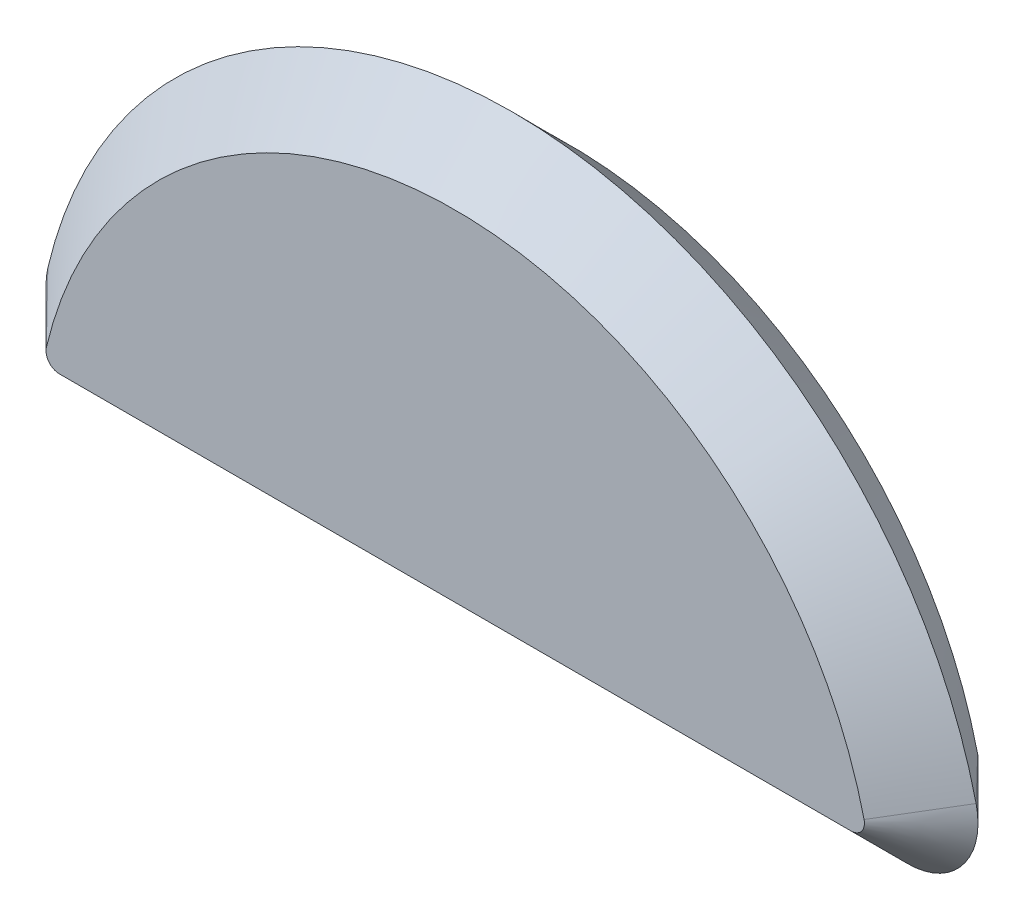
ISO-10303-21;
HEADER;
FILE_DESCRIPTION(('STEP AP214'),'2;1');
FILE_NAME('part.step','',(''),(''),'','','');
FILE_SCHEMA(('AUTOMOTIVE_DESIGN { 1 0 10303 214 1 1 1 1 }'));
ENDSEC;
DATA;
#1=APPLICATION_CONTEXT('core data for automotive mechanical design processes');
#2=APPLICATION_PROTOCOL_DEFINITION('international standard','automotive_design',2000,#1);
#3=PRODUCT_CONTEXT('',#1,'mechanical');
#4=PRODUCT('Part','Part','',(#3));
#5=PRODUCT_RELATED_PRODUCT_CATEGORY('part','',(#4));
#6=PRODUCT_DEFINITION_FORMATION('','',#4);
#7=PRODUCT_DEFINITION_CONTEXT('part definition',#1,'design');
#8=PRODUCT_DEFINITION('design','',#6,#7);
#9=PRODUCT_DEFINITION_SHAPE('','',#8);
#10=(LENGTH_UNIT() NAMED_UNIT(*) SI_UNIT(.MILLI.,.METRE.));
#11=(NAMED_UNIT(*) PLANE_ANGLE_UNIT() SI_UNIT($,.RADIAN.));
#12=(NAMED_UNIT(*) SI_UNIT($,.STERADIAN.) SOLID_ANGLE_UNIT());
#13=UNCERTAINTY_MEASURE_WITH_UNIT(LENGTH_MEASURE(1.E-05),#10,'distance_accuracy_value','');
#14=(GEOMETRIC_REPRESENTATION_CONTEXT(3) GLOBAL_UNCERTAINTY_ASSIGNED_CONTEXT((#13)) GLOBAL_UNIT_ASSIGNED_CONTEXT((#10,
#11,#12)) REPRESENTATION_CONTEXT('',''));
#15=CARTESIAN_POINT('',(0.,0.,0.));
#16=DIRECTION('',(0.,0.,1.));
#17=DIRECTION('',(1.,0.,0.));
#18=AXIS2_PLACEMENT_3D('',#15,#16,#17);
#19=CARTESIAN_POINT('',(-75.1410823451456,17.7799999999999,0.));
#20=DIRECTION('',(0.,0.,-1.));
#21=DIRECTION('',(-0.999999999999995,0.,0.));
#22=AXIS2_PLACEMENT_3D('',#19,#20,#21);
#23=CONICAL_SURFACE('',#22,2.53999999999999,0.785398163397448);
#24=DIRECTION('',(-0.688105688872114,0.162820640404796,-0.707106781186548));
#25=VECTOR('',#24,1.);
#26=CARTESIAN_POINT('',(-77.6128284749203,18.3648684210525,4.44089209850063E-13));
#27=LINE('',#26,#25);
#28=CARTESIAN_POINT('',(-77.6128284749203,18.3648684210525,4.44089209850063E-13));
#29=VERTEX_POINT('',#28);
#30=CARTESIAN_POINT('',(-88.0995591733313,20.8462549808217,-10.776307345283));
#31=VERTEX_POINT('',#30);
#32=EDGE_CURVE('E153',#29,#31,#27,.T.);
#33=ORIENTED_EDGE('',*,*,#32,.T.);
#34=CARTESIAN_POINT('',(-75.1410823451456,17.7799999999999,-10.776307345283));
#35=DIRECTION('',(0.,0.,1.));
#36=DIRECTION('',(0.999999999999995,0.,0.));
#37=AXIS2_PLACEMENT_3D('',#34,#35,#36);
#38=CIRCLE('',#37,13.316307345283);
#39=CARTESIAN_POINT('',(-75.1410823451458,4.46369265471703,-10.7763073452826));
#40=VERTEX_POINT('',#39);
#41=EDGE_CURVE('E38',#31,#40,#38,.T.);
#42=ORIENTED_EDGE('',*,*,#41,.T.);
#43=DIRECTION('',(0.,-0.707106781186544,-0.707106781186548));
#44=VECTOR('',#43,1.);
#45=CARTESIAN_POINT('',(-75.1410823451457,15.2399999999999,0.));
#46=LINE('',#45,#44);
#47=CARTESIAN_POINT('',(-75.1410823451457,15.2399999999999,0.));
#48=VERTEX_POINT('',#47);
#49=EDGE_CURVE('E166',#48,#40,#46,.T.);
#50=ORIENTED_EDGE('',*,*,#49,.F.);
#51=CARTESIAN_POINT('',(-75.1410823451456,17.7799999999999,0.));
#52=DIRECTION('',(0.,0.,1.));
#53=DIRECTION('',(0.999999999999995,0.,0.));
#54=AXIS2_PLACEMENT_3D('',#51,#52,#53);
#55=CIRCLE('',#54,2.53999999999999);
#56=EDGE_CURVE('E11',#29,#48,#55,.T.);
#57=ORIENTED_EDGE('',*,*,#56,.F.);
#58=EDGE_LOOP('',(#33,#42,#50,#57));
#59=FACE_BOUND('',#58,.T.);
#60=ADVANCED_FACE('F30',(#59),#23,.T.);
#61=CARTESIAN_POINT('',(-75.1410823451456,17.7799999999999,-10.776307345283));
#62=DIRECTION('',(0.,0.,1.));
#63=DIRECTION('',(0.999999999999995,0.,0.));
#64=AXIS2_PLACEMENT_3D('',#61,#62,#63);
#65=CONICAL_SURFACE('',#64,13.316307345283,0.785398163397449);
#66=DIRECTION('',(0.688105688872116,-0.162820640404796,-0.707106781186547));
#67=VECTOR('',#66,1.);
#68=CARTESIAN_POINT('',(-88.0995591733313,20.8462549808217,-10.776307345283));
#69=LINE('',#68,#67);
#70=CARTESIAN_POINT('',(-77.6128284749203,18.3648684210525,-21.5526146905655));
#71=VERTEX_POINT('',#70);
#72=EDGE_CURVE('E151',#31,#71,#69,.T.);
#73=ORIENTED_EDGE('',*,*,#72,.T.);
#74=CARTESIAN_POINT('',(-75.1410823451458,17.7799999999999,-21.552614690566));
#75=DIRECTION('',(0.,0.,1.));
#76=DIRECTION('',(0.999999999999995,0.,0.));
#77=AXIS2_PLACEMENT_3D('',#74,#75,#76);
#78=CIRCLE('',#77,2.53999999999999);
#79=CARTESIAN_POINT('',(-75.1410823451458,15.2399999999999,-21.552614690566));
#80=VERTEX_POINT('',#79);
#81=EDGE_CURVE('E102',#71,#80,#78,.T.);
#82=ORIENTED_EDGE('',*,*,#81,.T.);
#83=DIRECTION('',(0.,0.707106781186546,-0.707106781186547));
#84=VECTOR('',#83,1.);
#85=CARTESIAN_POINT('',(-75.1410823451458,4.46369265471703,-10.7763073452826));
#86=LINE('',#85,#84);
#87=EDGE_CURVE('E164',#40,#80,#86,.T.);
#88=ORIENTED_EDGE('',*,*,#87,.F.);
#89=ORIENTED_EDGE('',*,*,#41,.F.);
#90=EDGE_LOOP('',(#73,#82,#88,#89));
#91=FACE_BOUND('',#90,.T.);
#92=ADVANCED_FACE('F205',(#91),#65,.T.);
#93=CARTESIAN_POINT('',(0.,0.,0.));
#94=DIRECTION('',(0.,0.,-1.));
#95=DIRECTION('',(-0.999999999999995,0.,0.));
#96=AXIS2_PLACEMENT_3D('',#93,#94,#95);
#97=CONICAL_SURFACE('',#96,79.756,0.785398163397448);
#98=DIRECTION('',(0.688105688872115,0.162820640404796,-0.707106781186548));
#99=VECTOR('',#98,1.);
#100=CARTESIAN_POINT('',(77.6128284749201,18.3648684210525,4.44089209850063E-13));
#101=LINE('',#100,#99);
#102=CARTESIAN_POINT('',(77.6128284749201,18.3648684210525,4.44089209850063E-13));
#103=VERTEX_POINT('',#102);
#104=CARTESIAN_POINT('',(88.0995591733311,20.8462549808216,-10.776307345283));
#105=VERTEX_POINT('',#104);
#106=EDGE_CURVE('E139',#103,#105,#101,.T.);
#107=ORIENTED_EDGE('',*,*,#106,.T.);
#108=CARTESIAN_POINT('',(0.,0.,-10.776307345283));
#109=DIRECTION('',(0.,0.,1.));
#110=DIRECTION('',(0.999999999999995,0.,0.));
#111=AXIS2_PLACEMENT_3D('',#108,#109,#110);
#112=CIRCLE('',#111,90.532307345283);
#113=EDGE_CURVE('E159',#105,#31,#112,.T.);
#114=ORIENTED_EDGE('',*,*,#113,.T.);
#115=ORIENTED_EDGE('',*,*,#32,.F.);
#116=CARTESIAN_POINT('',(0.,0.,0.));
#117=DIRECTION('',(0.,0.,1.));
#118=DIRECTION('',(0.999999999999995,0.,0.));
#119=AXIS2_PLACEMENT_3D('',#116,#117,#118);
#120=CIRCLE('',#119,79.756);
#121=EDGE_CURVE('E162',#103,#29,#120,.T.);
#122=ORIENTED_EDGE('',*,*,#121,.F.);
#123=EDGE_LOOP('',(#107,#114,#115,#122));
#124=FACE_BOUND('',#123,.T.);
#125=ADVANCED_FACE('F195',(#124),#97,.T.);
#126=CARTESIAN_POINT('',(0.,0.,-10.776307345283));
#127=DIRECTION('',(0.,0.,1.));
#128=DIRECTION('',(0.999999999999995,0.,0.));
#129=AXIS2_PLACEMENT_3D('',#126,#127,#128);
#130=CONICAL_SURFACE('',#129,90.532307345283,0.785398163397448);
#131=DIRECTION('',(-0.688105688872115,-0.162820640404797,-0.707106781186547));
#132=VECTOR('',#131,1.);
#133=CARTESIAN_POINT('',(88.0995591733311,20.8462549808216,-10.776307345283));
#134=LINE('',#133,#132);
#135=CARTESIAN_POINT('',(77.61282847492,18.3648684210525,-21.5526146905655));
#136=VERTEX_POINT('',#135);
#137=EDGE_CURVE('E137',#105,#136,#134,.T.);
#138=ORIENTED_EDGE('',*,*,#137,.T.);
#139=CARTESIAN_POINT('',(0.,0.,-21.552614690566));
#140=DIRECTION('',(0.,0.,1.));
#141=DIRECTION('',(0.999999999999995,0.,0.));
#142=AXIS2_PLACEMENT_3D('',#139,#140,#141);
#143=CIRCLE('',#142,79.756);
#144=EDGE_CURVE('E156',#136,#71,#143,.T.);
#145=ORIENTED_EDGE('',*,*,#144,.T.);
#146=ORIENTED_EDGE('',*,*,#72,.F.);
#147=ORIENTED_EDGE('',*,*,#113,.F.);
#148=EDGE_LOOP('',(#138,#145,#146,#147));
#149=FACE_BOUND('',#148,.T.);
#150=ADVANCED_FACE('F190',(#149),#130,.T.);
#151=CARTESIAN_POINT('',(75.1410823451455,17.7799999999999,4.44089209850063E-13));
#152=DIRECTION('',(0.,0.,-1.));
#153=DIRECTION('',(-0.999999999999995,0.,0.));
#154=AXIS2_PLACEMENT_3D('',#151,#152,#153);
#155=CONICAL_SURFACE('',#154,2.54,0.785398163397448);
#156=DIRECTION('',(0.,-0.707106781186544,-0.707106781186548));
#157=VECTOR('',#156,1.);
#158=CARTESIAN_POINT('',(75.1410823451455,15.2399999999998,0.));
#159=LINE('',#158,#157);
#160=CARTESIAN_POINT('',(75.1410823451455,15.2399999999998,0.));
#161=VERTEX_POINT('',#160);
#162=CARTESIAN_POINT('',(75.1410823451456,4.46369265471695,-10.7763073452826));
#163=VERTEX_POINT('',#162);
#164=EDGE_CURVE('E127',#161,#163,#159,.T.);
#165=ORIENTED_EDGE('',*,*,#164,.T.);
#166=CARTESIAN_POINT('',(75.1410823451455,17.7799999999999,-10.7763073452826));
#167=DIRECTION('',(0.,0.,1.));
#168=DIRECTION('',(0.999999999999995,0.,0.));
#169=AXIS2_PLACEMENT_3D('',#166,#167,#168);
#170=CIRCLE('',#169,13.316307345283);
#171=EDGE_CURVE('E146',#163,#105,#170,.T.);
#172=ORIENTED_EDGE('',*,*,#171,.T.);
#173=ORIENTED_EDGE('',*,*,#106,.F.);
#174=CARTESIAN_POINT('',(75.1410823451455,17.7799999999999,4.44089209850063E-13));
#175=DIRECTION('',(0.,0.,1.));
#176=DIRECTION('',(0.999999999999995,0.,0.));
#177=AXIS2_PLACEMENT_3D('',#174,#175,#176);
#178=CIRCLE('',#177,2.54);
#179=EDGE_CURVE('E149',#161,#103,#178,.T.);
#180=ORIENTED_EDGE('',*,*,#179,.F.);
#181=EDGE_LOOP('',(#165,#172,#173,#180));
#182=FACE_BOUND('',#181,.T.);
#183=ADVANCED_FACE('F198',(#182),#155,.T.);
#184=CARTESIAN_POINT('',(75.1410823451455,17.7799999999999,-10.7763073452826));
#185=DIRECTION('',(0.,0.,1.));
#186=DIRECTION('',(0.999999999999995,0.,0.));
#187=AXIS2_PLACEMENT_3D('',#184,#185,#186);
#188=CONICAL_SURFACE('',#187,13.316307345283,0.785398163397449);
#189=DIRECTION('',(0.,0.707106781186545,-0.707106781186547));
#190=VECTOR('',#189,1.);
#191=CARTESIAN_POINT('',(75.1410823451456,4.46369265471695,-10.7763073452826));
#192=LINE('',#191,#190);
#193=CARTESIAN_POINT('',(75.1410823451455,15.2399999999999,-21.552614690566));
#194=VERTEX_POINT('',#193);
#195=EDGE_CURVE('E134',#163,#194,#192,.T.);
#196=ORIENTED_EDGE('',*,*,#195,.T.);
#197=CARTESIAN_POINT('',(75.1410823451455,17.7799999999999,-21.5526146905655));
#198=DIRECTION('',(0.,0.,1.));
#199=DIRECTION('',(0.999999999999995,0.,0.));
#200=AXIS2_PLACEMENT_3D('',#197,#198,#199);
#201=CIRCLE('',#200,2.53999999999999);
#202=EDGE_CURVE('E143',#194,#136,#201,.T.);
#203=ORIENTED_EDGE('',*,*,#202,.T.);
#204=ORIENTED_EDGE('',*,*,#137,.F.);
#205=ORIENTED_EDGE('',*,*,#171,.F.);
#206=EDGE_LOOP('',(#196,#203,#204,#205));
#207=FACE_BOUND('',#206,.T.);
#208=ADVANCED_FACE('F187',(#207),#188,.T.);
#209=CARTESIAN_POINT('',(75.1410823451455,15.2399999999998,0.));
#210=DIRECTION('',(0.,0.707106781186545,-0.707106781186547));
#211=DIRECTION('',(0.,0.707106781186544,0.707106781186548));
#212=AXIS2_PLACEMENT_3D('',#209,#210,#211);
#213=PLANE('',#212);
#214=DIRECTION('',(-0.999999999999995,0.,0.));
#215=VECTOR('',#214,1.);
#216=CARTESIAN_POINT('',(75.1410823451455,15.2399999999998,0.));
#217=LINE('',#216,#215);
#218=EDGE_CURVE('E140',#161,#48,#217,.T.);
#219=ORIENTED_EDGE('',*,*,#218,.T.);
#220=ORIENTED_EDGE('',*,*,#49,.T.);
#221=DIRECTION('',(-0.999999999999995,0.,0.));
#222=VECTOR('',#221,1.);
#223=CARTESIAN_POINT('',(75.1410823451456,4.46369265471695,-10.7763073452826));
#224=LINE('',#223,#222);
#225=EDGE_CURVE('E52',#163,#40,#224,.T.);
#226=ORIENTED_EDGE('',*,*,#225,.F.);
#227=ORIENTED_EDGE('',*,*,#164,.F.);
#228=EDGE_LOOP('',(#219,#220,#226,#227));
#229=FACE_BOUND('',#228,.T.);
#230=ADVANCED_FACE('F201',(#229),#213,.F.);
#231=CARTESIAN_POINT('',(75.1410823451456,4.46369265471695,-10.7763073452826));
#232=DIRECTION('',(0.,0.707106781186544,0.707106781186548));
#233=DIRECTION('',(0.,-0.707106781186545,0.707106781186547));
#234=AXIS2_PLACEMENT_3D('',#231,#232,#233);
#235=PLANE('',#234);
#236=ORIENTED_EDGE('',*,*,#225,.T.);
#237=ORIENTED_EDGE('',*,*,#87,.T.);
#238=DIRECTION('',(-0.999999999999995,0.,0.));
#239=VECTOR('',#238,1.);
#240=CARTESIAN_POINT('',(75.1410823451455,15.2399999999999,-21.552614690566));
#241=LINE('',#240,#239);
#242=EDGE_CURVE('E136',#194,#80,#241,.T.);
#243=ORIENTED_EDGE('',*,*,#242,.F.);
#244=ORIENTED_EDGE('',*,*,#195,.F.);
#245=EDGE_LOOP('',(#236,#237,#243,#244));
#246=FACE_BOUND('',#245,.T.);
#247=ADVANCED_FACE('F181',(#246),#235,.F.);
#248=CARTESIAN_POINT('',(0.,0.,-21.5526646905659));
#249=DIRECTION('',(0.,0.,1.));
#250=DIRECTION('',(0.999999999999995,0.,0.));
#251=AXIS2_PLACEMENT_3D('',#248,#249,#250);
#252=PLANE('',#251);
#253=CARTESIAN_POINT('',(0.,0.,-21.5526646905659));
#254=DIRECTION('',(0.,0.,1.));
#255=DIRECTION('',(0.999999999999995,0.,0.));
#256=AXIS2_PLACEMENT_3D('',#253,#254,#255);
#257=CIRCLE('',#256,79.756);
#258=CARTESIAN_POINT('',(77.61282847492,18.3648684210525,-21.5526646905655));
#259=VERTEX_POINT('',#258);
#260=CARTESIAN_POINT('',(-77.6128284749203,18.3648684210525,-21.5526646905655));
#261=VERTEX_POINT('',#260);
#262=EDGE_CURVE('E114',#259,#261,#257,.T.);
#263=ORIENTED_EDGE('',*,*,#262,.F.);
#264=CARTESIAN_POINT('',(75.1410823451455,17.7799999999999,-21.5526646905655));
#265=DIRECTION('',(0.,0.,1.));
#266=DIRECTION('',(-0.999999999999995,0.,0.));
#267=AXIS2_PLACEMENT_3D('',#264,#265,#266);
#268=CIRCLE('',#267,2.54);
#269=CARTESIAN_POINT('',(75.1410823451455,15.2399999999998,-21.5526646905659));
#270=VERTEX_POINT('',#269);
#271=EDGE_CURVE('E107',#270,#259,#268,.T.);
#272=ORIENTED_EDGE('',*,*,#271,.F.);
#273=DIRECTION('',(0.999999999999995,0.,0.));
#274=VECTOR('',#273,1.);
#275=CARTESIAN_POINT('',(-75.1410823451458,15.2399999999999,-21.5526646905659));
#276=LINE('',#275,#274);
#277=CARTESIAN_POINT('',(-75.1410823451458,15.2399999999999,-21.5526646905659));
#278=VERTEX_POINT('',#277);
#279=EDGE_CURVE('E117',#278,#270,#276,.T.);
#280=ORIENTED_EDGE('',*,*,#279,.F.);
#281=CARTESIAN_POINT('',(-75.1410823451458,17.7799999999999,-21.5526646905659));
#282=DIRECTION('',(0.,0.,1.));
#283=DIRECTION('',(0.999999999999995,0.,0.));
#284=AXIS2_PLACEMENT_3D('',#281,#282,#283);
#285=CIRCLE('',#284,2.54);
#286=EDGE_CURVE('E101',#261,#278,#285,.T.);
#287=ORIENTED_EDGE('',*,*,#286,.F.);
#288=EDGE_LOOP('',(#263,#272,#280,#287));
#289=FACE_BOUND('',#288,.T.);
#290=ADVANCED_FACE('F112',(#289),#252,.F.);
#291=CARTESIAN_POINT('',(-75.1410823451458,17.7799999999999,-21.5526646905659));
#292=DIRECTION('',(0.,0.,1.));
#293=DIRECTION('',(0.999999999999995,0.,0.));
#294=AXIS2_PLACEMENT_3D('',#291,#292,#293);
#295=CYLINDRICAL_SURFACE('',#294,2.54);
#296=DIRECTION('',(0.,0.,1.));
#297=VECTOR('',#296,1.);
#298=CARTESIAN_POINT('',(-75.1410823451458,15.2399999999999,-21.5526646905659));
#299=LINE('',#298,#297);
#300=EDGE_CURVE('E106',#278,#80,#299,.T.);
#301=ORIENTED_EDGE('',*,*,#300,.T.);
#302=ORIENTED_EDGE('',*,*,#81,.F.);
#303=DIRECTION('',(0.,0.,1.));
#304=VECTOR('',#303,1.);
#305=CARTESIAN_POINT('',(-77.6128284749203,18.3648684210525,-21.5526646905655));
#306=LINE('',#305,#304);
#307=EDGE_CURVE('E97',#261,#71,#306,.T.);
#308=ORIENTED_EDGE('',*,*,#307,.F.);
#309=ORIENTED_EDGE('',*,*,#286,.T.);
#310=EDGE_LOOP('',(#301,#302,#308,#309));
#311=FACE_BOUND('',#310,.T.);
#312=ADVANCED_FACE('F100',(#311),#295,.T.);
#313=CARTESIAN_POINT('',(75.1410823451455,17.7799999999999,-21.5526646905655));
#314=DIRECTION('',(0.,0.,1.));
#315=DIRECTION('',(0.999999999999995,0.,0.));
#316=AXIS2_PLACEMENT_3D('',#313,#314,#315);
#317=CYLINDRICAL_SURFACE('',#316,2.54);
#318=DIRECTION('',(0.,0.,1.));
#319=VECTOR('',#318,1.);
#320=CARTESIAN_POINT('',(77.61282847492,18.3648684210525,-21.5526646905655));
#321=LINE('',#320,#319);
#322=EDGE_CURVE('E121',#259,#136,#321,.T.);
#323=ORIENTED_EDGE('',*,*,#322,.T.);
#324=ORIENTED_EDGE('',*,*,#202,.F.);
#325=DIRECTION('',(0.,0.,1.));
#326=VECTOR('',#325,1.);
#327=CARTESIAN_POINT('',(75.1410823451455,15.2399999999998,-21.5526646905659));
#328=LINE('',#327,#326);
#329=EDGE_CURVE('E128',#270,#194,#328,.T.);
#330=ORIENTED_EDGE('',*,*,#329,.F.);
#331=ORIENTED_EDGE('',*,*,#271,.T.);
#332=EDGE_LOOP('',(#323,#324,#330,#331));
#333=FACE_BOUND('',#332,.T.);
#334=ADVANCED_FACE('F184',(#333),#317,.T.);
#335=CARTESIAN_POINT('',(0.,0.,-21.5526646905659));
#336=DIRECTION('',(0.,0.,1.));
#337=DIRECTION('',(0.999999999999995,0.,0.));
#338=AXIS2_PLACEMENT_3D('',#335,#336,#337);
#339=CYLINDRICAL_SURFACE('',#338,79.756);
#340=ORIENTED_EDGE('',*,*,#307,.T.);
#341=ORIENTED_EDGE('',*,*,#144,.F.);
#342=ORIENTED_EDGE('',*,*,#322,.F.);
#343=ORIENTED_EDGE('',*,*,#262,.T.);
#344=EDGE_LOOP('',(#340,#341,#342,#343));
#345=FACE_BOUND('',#344,.T.);
#346=ADVANCED_FACE('F119',(#345),#339,.T.);
#347=CARTESIAN_POINT('',(-75.1410823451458,15.2399999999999,-21.5526646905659));
#348=DIRECTION('',(0.,-0.999999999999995,0.));
#349=DIRECTION('',(0.,0.,-1.));
#350=AXIS2_PLACEMENT_3D('',#347,#348,#349);
#351=PLANE('',#350);
#352=ORIENTED_EDGE('',*,*,#242,.T.);
#353=ORIENTED_EDGE('',*,*,#300,.F.);
#354=ORIENTED_EDGE('',*,*,#279,.T.);
#355=ORIENTED_EDGE('',*,*,#329,.T.);
#356=EDGE_LOOP('',(#352,#353,#354,#355));
#357=FACE_BOUND('',#356,.T.);
#358=ADVANCED_FACE('F179',(#357),#351,.T.);
#359=CARTESIAN_POINT('',(0.,0.,0.));
#360=DIRECTION('',(0.,0.,1.));
#361=DIRECTION('',(0.999999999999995,0.,0.));
#362=AXIS2_PLACEMENT_3D('',#359,#360,#361);
#363=PLANE('',#362);
#364=ORIENTED_EDGE('',*,*,#121,.T.);
#365=ORIENTED_EDGE('',*,*,#56,.T.);
#366=ORIENTED_EDGE('',*,*,#218,.F.);
#367=ORIENTED_EDGE('',*,*,#179,.T.);
#368=EDGE_LOOP('',(#364,#365,#366,#367));
#369=FACE_BOUND('',#368,.T.);
#370=ADVANCED_FACE('F231',(#369),#363,.T.);
#371=CLOSED_SHELL('',(#60,#92,#125,#150,#183,#208,#230,#247,#290,#312,#334,#346,#358,#370));
#372=MANIFOLD_SOLID_BREP('B2',#371);
#373=ADVANCED_BREP_SHAPE_REPRESENTATION('',(#18,#372),#14);
#374=SHAPE_DEFINITION_REPRESENTATION(#9,#373);
ENDSEC;
END-ISO-10303-21;
